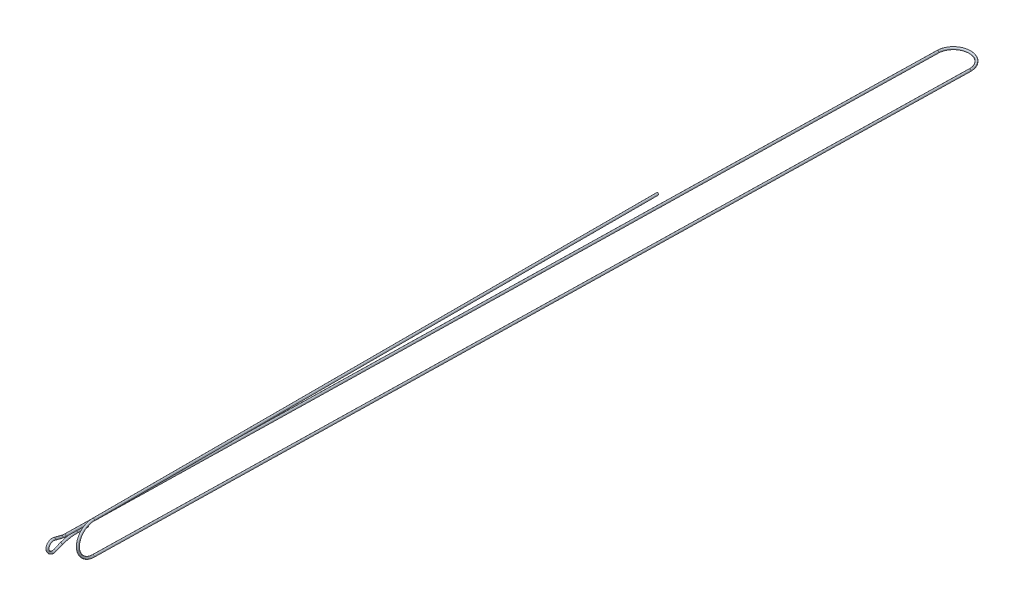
ISO-10303-21;
HEADER;
FILE_DESCRIPTION(('STEP AP214'),'2;1');
FILE_NAME('part.step','',(''),(''),'','','');
FILE_SCHEMA(('AUTOMOTIVE_DESIGN { 1 0 10303 214 1 1 1 1 }'));
ENDSEC;
DATA;
#1=APPLICATION_CONTEXT('core data for automotive mechanical design processes');
#2=APPLICATION_PROTOCOL_DEFINITION('international standard','automotive_design',2000,#1);
#3=PRODUCT_CONTEXT('',#1,'mechanical');
#4=PRODUCT('Part','Part','',(#3));
#5=PRODUCT_RELATED_PRODUCT_CATEGORY('part','',(#4));
#6=PRODUCT_DEFINITION_FORMATION('','',#4);
#7=PRODUCT_DEFINITION_CONTEXT('part definition',#1,'design');
#8=PRODUCT_DEFINITION('design','',#6,#7);
#9=PRODUCT_DEFINITION_SHAPE('','',#8);
#10=(LENGTH_UNIT() NAMED_UNIT(*) SI_UNIT(.MILLI.,.METRE.));
#11=(NAMED_UNIT(*) PLANE_ANGLE_UNIT() SI_UNIT($,.RADIAN.));
#12=(NAMED_UNIT(*) SI_UNIT($,.STERADIAN.) SOLID_ANGLE_UNIT());
#13=UNCERTAINTY_MEASURE_WITH_UNIT(LENGTH_MEASURE(1.E-05),#10,'distance_accuracy_value','');
#14=(GEOMETRIC_REPRESENTATION_CONTEXT(3) GLOBAL_UNCERTAINTY_ASSIGNED_CONTEXT((#13)) GLOBAL_UNIT_ASSIGNED_CONTEXT((#10,
#11,#12)) REPRESENTATION_CONTEXT('',''));
#15=CARTESIAN_POINT('',(0.,0.,0.));
#16=DIRECTION('',(0.,0.,1.));
#17=DIRECTION('',(1.,0.,0.));
#18=AXIS2_PLACEMENT_3D('',#15,#16,#17);
#19=CARTESIAN_POINT('',(-59.,-34.457737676,-47.37419265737));
#20=DIRECTION('',(0.,-0.02006993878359,-0.9997985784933));
#21=DIRECTION('',(0.,0.9997985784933,-0.02006993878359));
#22=AXIS2_PLACEMENT_3D('',#19,#20,#21);
#23=PLANE('',#22);
#24=CARTESIAN_POINT('',(-59.,-34.4577376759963,-47.3741926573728));
#25=DIRECTION('',(0.,-0.02006993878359,-0.9997985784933));
#26=DIRECTION('',(0.,0.9997985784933,-0.02006993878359));
#27=AXIS2_PLACEMENT_3D('',#24,#25,#26);
#28=CIRCLE('',#27,2.);
#29=CARTESIAN_POINT('',(-59.,-32.4581405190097,-47.41433253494));
#30=VERTEX_POINT('',#29);
#31=EDGE_CURVE('E42',#30,#30,#28,.F.);
#32=ORIENTED_EDGE('',*,*,#31,.F.);
#33=EDGE_LOOP('',(#32));
#34=FACE_BOUND('',#33,.T.);
#35=ADVANCED_FACE('F39',(#34),#23,.T.);
#36=CARTESIAN_POINT('',(-59.,-34.05625803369,-27.37419265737));
#37=DIRECTION('',(0.,-0.02006993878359,-0.9997985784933));
#38=DIRECTION('',(0.,0.9997985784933,-0.02006993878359));
#39=AXIS2_PLACEMENT_3D('',#36,#37,#38);
#40=CYLINDRICAL_SURFACE('',#39,2.);
#41=ORIENTED_EDGE('',*,*,#31,.T.);
#42=EDGE_LOOP('',(#41));
#43=FACE_BOUND('',#42,.T.);
#44=CARTESIAN_POINT('',(-59.,-34.0562580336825,-27.3741926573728));
#45=DIRECTION('',(0.,-0.0200699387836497,-0.999798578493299));
#46=DIRECTION('',(0.,0.999798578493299,-0.0200699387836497));
#47=AXIS2_PLACEMENT_3D('',#44,#45,#46);
#48=CIRCLE('',#47,2.);
#49=CARTESIAN_POINT('',(-59.,-32.0566608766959,-27.4143325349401));
#50=VERTEX_POINT('',#49);
#51=EDGE_CURVE('E136',#50,#50,#48,.F.);
#52=ORIENTED_EDGE('',*,*,#51,.F.);
#53=EDGE_LOOP('',(#52));
#54=FACE_BOUND('',#53,.T.);
#55=ADVANCED_FACE('F132',(#43,#54),#40,.T.);
#56=CARTESIAN_POINT('',(-59.,-106.0417556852,-25.92915706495));
#57=DIRECTION('',(-1.,0.,0.));
#58=DIRECTION('',(0.,-0.930873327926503,-0.365342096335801));
#59=AXIS2_PLACEMENT_3D('',#56,#57,#58);
#60=TOROIDAL_SURFACE('',#59,72.,2.);
#61=ORIENTED_EDGE('',*,*,#51,.T.);
#62=EDGE_LOOP('',(#61));
#63=FACE_BOUND('',#62,.T.);
#64=CARTESIAN_POINT('',(-59.,-39.0188760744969,0.375473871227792));
#65=DIRECTION('',(0.,0.365342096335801,-0.930873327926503));
#66=DIRECTION('',(0.,0.930873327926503,0.365342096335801));
#67=AXIS2_PLACEMENT_3D('',#64,#65,#66);
#68=CIRCLE('',#67,2.);
#69=CARTESIAN_POINT('',(-59.,-37.1571294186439,1.10615806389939));
#70=VERTEX_POINT('',#69);
#71=EDGE_CURVE('E135',#70,#70,#68,.F.);
#72=ORIENTED_EDGE('',*,*,#71,.F.);
#73=EDGE_LOOP('',(#72));
#74=FACE_BOUND('',#73,.T.);
#75=ADVANCED_FACE('F128',(#63,#74),#60,.T.);
#76=CARTESIAN_POINT('',(-59.,-43.73964859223,12.40376534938));
#77=DIRECTION('',(0.,0.365342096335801,-0.930873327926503));
#78=DIRECTION('',(0.,0.930873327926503,0.365342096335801));
#79=AXIS2_PLACEMENT_3D('',#76,#77,#78);
#80=CYLINDRICAL_SURFACE('',#79,2.);
#81=ORIENTED_EDGE('',*,*,#71,.T.);
#82=EDGE_LOOP('',(#81));
#83=FACE_BOUND('',#82,.T.);
#84=CARTESIAN_POINT('',(-59.,-43.7396485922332,12.4037653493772));
#85=DIRECTION('',(0.,0.365342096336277,-0.930873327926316));
#86=DIRECTION('',(0.,-0.930873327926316,-0.365342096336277));
#87=AXIS2_PLACEMENT_3D('',#84,#85,#86);
#88=CIRCLE('',#87,2.);
#89=CARTESIAN_POINT('',(-59.,-45.6013952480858,11.6730811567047));
#90=VERTEX_POINT('',#89);
#91=EDGE_CURVE('E117',#90,#90,#88,.F.);
#92=ORIENTED_EDGE('',*,*,#91,.F.);
#93=EDGE_LOOP('',(#92));
#94=FACE_BOUND('',#93,.T.);
#95=ADVANCED_FACE('F124',(#83,#94),#80,.T.);
#96=CARTESIAN_POINT('',(-59.,-34.43091531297,16.05718631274));
#97=DIRECTION('',(1.,0.,0.));
#98=DIRECTION('',(0.,-0.969126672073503,0.246563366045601));
#99=AXIS2_PLACEMENT_3D('',#96,#97,#98);
#100=TOROIDAL_SURFACE('',#99,10.,2.);
#101=ORIENTED_EDGE('',*,*,#91,.T.);
#102=EDGE_LOOP('',(#101));
#103=FACE_BOUND('',#102,.T.);
#104=CARTESIAN_POINT('',(-59.,-24.7396485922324,13.5915526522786));
#105=DIRECTION('',(0.,0.246563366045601,0.969126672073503));
#106=DIRECTION('',(0.,-0.969126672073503,0.246563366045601));
#107=AXIS2_PLACEMENT_3D('',#104,#105,#106);
#108=CIRCLE('',#107,2.);
#109=CARTESIAN_POINT('',(-59.,-26.6779019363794,14.0846793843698));
#110=VERTEX_POINT('',#109);
#111=EDGE_CURVE('E111',#110,#110,#108,.F.);
#112=ORIENTED_EDGE('',*,*,#111,.F.);
#113=EDGE_LOOP('',(#112));
#114=FACE_BOUND('',#113,.T.);
#115=ADVANCED_FACE('F121',(#103,#114),#100,.T.);
#116=CARTESIAN_POINT('',(-59.,-28.36599839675,-0.6619529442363));
#117=DIRECTION('',(0.,0.246563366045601,0.969126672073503));
#118=DIRECTION('',(0.,-0.969126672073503,0.246563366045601));
#119=AXIS2_PLACEMENT_3D('',#116,#117,#118);
#120=CYLINDRICAL_SURFACE('',#119,2.);
#121=ORIENTED_EDGE('',*,*,#111,.T.);
#122=EDGE_LOOP('',(#121));
#123=FACE_BOUND('',#122,.T.);
#124=CARTESIAN_POINT('',(-59.,-28.3659983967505,-0.661952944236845));
#125=DIRECTION('',(0.,0.246563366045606,0.969126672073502));
#126=DIRECTION('',(0.,-0.969126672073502,0.246563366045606));
#127=AXIS2_PLACEMENT_3D('',#124,#125,#126);
#128=CIRCLE('',#127,2.);
#129=CARTESIAN_POINT('',(-59.,-30.3042517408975,-0.168826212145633));
#130=VERTEX_POINT('',#129);
#131=EDGE_CURVE('E108',#130,#130,#128,.F.);
#132=ORIENTED_EDGE('',*,*,#131,.F.);
#133=EDGE_LOOP('',(#132));
#134=FACE_BOUND('',#133,.T.);
#135=ADVANCED_FACE('F103',(#123,#134),#120,.T.);
#136=CARTESIAN_POINT('',(-59.,-4.137831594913,-6.826037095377));
#137=DIRECTION('',(-1.,0.,0.));
#138=DIRECTION('',(0.,0.9997985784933,-0.02006993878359));
#139=AXIS2_PLACEMENT_3D('',#136,#137,#138);
#140=TOROIDAL_SURFACE('',#139,25.,2.);
#141=ORIENTED_EDGE('',*,*,#131,.T.);
#142=EDGE_LOOP('',(#141));
#143=FACE_BOUND('',#142,.T.);
#144=CARTESIAN_POINT('',(-59.,-29.1327960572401,-6.32428862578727));
#145=DIRECTION('',(0.,0.02006993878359,0.9997985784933));
#146=DIRECTION('',(0.,-0.9997985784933,0.02006993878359));
#147=AXIS2_PLACEMENT_3D('',#144,#145,#146);
#148=CIRCLE('',#147,2.);
#149=CARTESIAN_POINT('',(-59.,-31.1323932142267,-6.28414874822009));
#150=VERTEX_POINT('',#149);
#151=EDGE_CURVE('E69',#150,#150,#148,.F.);
#152=ORIENTED_EDGE('',*,*,#151,.F.);
#153=EDGE_LOOP('',(#152));
#154=FACE_BOUND('',#153,.T.);
#155=ADVANCED_FACE('F98',(#143,#154),#140,.T.);
#156=CARTESIAN_POINT('',(-59.,-61.44539749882,-1616.));
#157=DIRECTION('',(0.,0.02006993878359,0.9997985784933));
#158=DIRECTION('',(0.,-0.9997985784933,0.02006993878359));
#159=AXIS2_PLACEMENT_3D('',#156,#157,#158);
#160=CYLINDRICAL_SURFACE('',#159,2.);
#161=CARTESIAN_POINT('',(-59.,-61.44539749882,-1616.));
#162=DIRECTION('',(0.,0.02006993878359,0.9997985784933));
#163=DIRECTION('',(-1.,0.,0.));
#164=AXIS2_PLACEMENT_3D('',#161,#162,#163);
#165=CIRCLE('',#164,2.);
#166=CARTESIAN_POINT('',(-61.,-61.44539749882,-1616.));
#167=VERTEX_POINT('',#166);
#168=EDGE_CURVE('E60',#167,#167,#165,.F.);
#169=ORIENTED_EDGE('',*,*,#168,.F.);
#170=EDGE_LOOP('',(#169));
#171=FACE_BOUND('',#170,.T.);
#172=ORIENTED_EDGE('',*,*,#151,.T.);
#173=EDGE_LOOP('',(#172));
#174=FACE_BOUND('',#173,.T.);
#175=ADVANCED_FACE('F94',(#171,#174),#160,.T.);
#176=CARTESIAN_POINT('',(0.,0.,0.));
#177=DIRECTION('',(1.,0.,0.));
#178=DIRECTION('',(0.,-1.,0.));
#179=AXIS2_PLACEMENT_3D('',#176,#177,#178);
#180=TOROIDAL_SURFACE('',#179,29.,2.);
#181=CARTESIAN_POINT('',(0.,-28.99415877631,0.582028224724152));
#182=DIRECTION('',(0.,-0.02006993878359,-0.9997985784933));
#183=DIRECTION('',(0.,0.9997985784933,-0.02006993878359));
#184=AXIS2_PLACEMENT_3D('',#181,#182,#183);
#185=CIRCLE('',#184,2.);
#186=CARTESIAN_POINT('',(0.,-26.9945616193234,0.541888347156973));
#187=VERTEX_POINT('',#186);
#188=EDGE_CURVE('E49',#187,#187,#185,.T.);
#189=ORIENTED_EDGE('',*,*,#188,.F.);
#190=EDGE_LOOP('',(#189));
#191=FACE_BOUND('',#190,.T.);
#192=CARTESIAN_POINT('',(0.,29.,0.));
#193=DIRECTION('',(0.,0.,1.));
#194=DIRECTION('',(0.,1.,0.));
#195=AXIS2_PLACEMENT_3D('',#192,#193,#194);
#196=CIRCLE('',#195,2.);
#197=CARTESIAN_POINT('',(0.,31.,0.));
#198=VERTEX_POINT('',#197);
#199=EDGE_CURVE('E61',#198,#198,#196,.T.);
#200=ORIENTED_EDGE('',*,*,#199,.T.);
#201=EDGE_LOOP('',(#200));
#202=FACE_BOUND('',#201,.T.);
#203=ADVANCED_FACE('F89',(#191,#202),#180,.T.);
#204=CARTESIAN_POINT('',(-29.5,-61.44539749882,-1616.));
#205=DIRECTION('',(0.,0.9997985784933,-0.02006993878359));
#206=DIRECTION('',(-1.,0.,0.));
#207=AXIS2_PLACEMENT_3D('',#204,#205,#206);
#208=TOROIDAL_SURFACE('',#207,29.5,2.);
#209=ORIENTED_EDGE('',*,*,#168,.T.);
#210=EDGE_LOOP('',(#209));
#211=FACE_BOUND('',#210,.T.);
#212=CARTESIAN_POINT('',(0.,-61.4453974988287,-1616.00000000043));
#213=DIRECTION('',(-1.46725850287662E-11,-0.02006993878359,-0.9997985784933));
#214=DIRECTION('',(1.,-2.94477883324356E-13,-1.46696296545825E-11));
#215=AXIS2_PLACEMENT_3D('',#212,#213,#214);
#216=CIRCLE('',#215,2.);
#217=CARTESIAN_POINT('',(0.,-59.445800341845,-1616.04013987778));
#218=VERTEX_POINT('',#217);
#219=CARTESIAN_POINT('',(2.,-61.4453974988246,-1616.00000000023));
#220=VERTEX_POINT('',#219);
#221=EDGE_CURVE('E54',#218,#220,#216,.T.);
#222=ORIENTED_EDGE('',*,*,#221,.T.);
#223=CARTESIAN_POINT('',(0.,-61.4453974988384,-1616.00000000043));
#224=DIRECTION('',(0.,-0.02006993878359,-0.9997985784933));
#225=DIRECTION('',(0.,0.9997985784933,-0.02006993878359));
#226=AXIS2_PLACEMENT_3D('',#223,#224,#225);
#227=CIRCLE('',#226,2.);
#228=EDGE_CURVE('E12',#218,#220,#227,.F.);
#229=ORIENTED_EDGE('',*,*,#228,.F.);
#230=EDGE_LOOP('',(#222,#229));
#231=FACE_BOUND('',#230,.T.);
#232=ADVANCED_FACE('F58',(#211,#231),#208,.T.);
#233=CARTESIAN_POINT('',(0.,-28.99415877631,0.5820282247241));
#234=DIRECTION('',(0.,-0.02006993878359,-0.9997985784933));
#235=DIRECTION('',(0.,0.9997985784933,-0.02006993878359));
#236=AXIS2_PLACEMENT_3D('',#233,#234,#235);
#237=CYLINDRICAL_SURFACE('',#236,2.);
#238=ORIENTED_EDGE('',*,*,#188,.T.);
#239=EDGE_LOOP('',(#238));
#240=FACE_BOUND('',#239,.T.);
#241=ORIENTED_EDGE('',*,*,#228,.T.);
#242=ORIENTED_EDGE('',*,*,#221,.F.);
#243=EDGE_LOOP('',(#241,#242));
#244=FACE_BOUND('',#243,.T.);
#245=ADVANCED_FACE('F56',(#240,#244),#237,.T.);
#246=CARTESIAN_POINT('',(0.,29.,-1040.));
#247=DIRECTION('',(0.,0.,1.));
#248=DIRECTION('',(1.,0.,0.));
#249=AXIS2_PLACEMENT_3D('',#246,#247,#248);
#250=CYLINDRICAL_SURFACE('',#249,2.);
#251=CARTESIAN_POINT('',(0.,29.,-1040.));
#252=DIRECTION('',(0.,0.,-1.));
#253=DIRECTION('',(-1.,0.,0.));
#254=AXIS2_PLACEMENT_3D('',#251,#252,#253);
#255=CIRCLE('',#254,2.);
#256=CARTESIAN_POINT('',(-2.,29.,-1040.));
#257=VERTEX_POINT('',#256);
#258=EDGE_CURVE('E145',#257,#257,#255,.T.);
#259=ORIENTED_EDGE('',*,*,#258,.F.);
#260=EDGE_LOOP('',(#259));
#261=FACE_BOUND('',#260,.T.);
#262=ORIENTED_EDGE('',*,*,#199,.F.);
#263=EDGE_LOOP('',(#262));
#264=FACE_BOUND('',#263,.T.);
#265=ADVANCED_FACE('F154',(#261,#264),#250,.T.);
#266=CARTESIAN_POINT('',(0.,29.,-1040.));
#267=DIRECTION('',(0.,0.,-1.));
#268=DIRECTION('',(-1.,0.,0.));
#269=AXIS2_PLACEMENT_3D('',#266,#267,#268);
#270=PLANE('',#269);
#271=ORIENTED_EDGE('',*,*,#258,.T.);
#272=EDGE_LOOP('',(#271));
#273=FACE_BOUND('',#272,.T.);
#274=ADVANCED_FACE('F152',(#273),#270,.T.);
#275=CLOSED_SHELL('',(#35,#55,#75,#95,#115,#135,#155,#175,#203,#232,#245,#265,#274));
#276=MANIFOLD_SOLID_BREP('B2',#275);
#277=ADVANCED_BREP_SHAPE_REPRESENTATION('',(#18,#276),#14);
#278=SHAPE_DEFINITION_REPRESENTATION(#9,#277);
ENDSEC;
END-ISO-10303-21;
